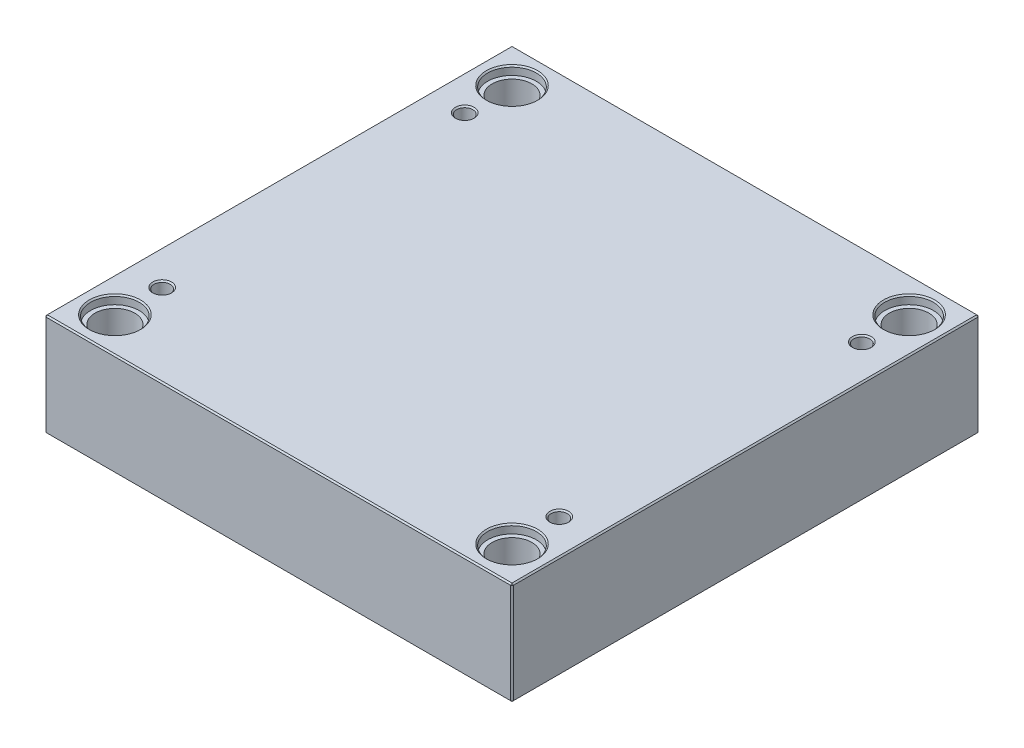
ISO-10303-21;
HEADER;
FILE_DESCRIPTION(('STEP AP214'),'2;1');
FILE_NAME('part.step','',(''),(''),'','','');
FILE_SCHEMA(('AUTOMOTIVE_DESIGN { 1 0 10303 214 1 1 1 1 }'));
ENDSEC;
DATA;
#1=APPLICATION_CONTEXT('core data for automotive mechanical design processes');
#2=APPLICATION_PROTOCOL_DEFINITION('international standard','automotive_design',2000,#1);
#3=PRODUCT_CONTEXT('',#1,'mechanical');
#4=PRODUCT('Part','Part','',(#3));
#5=PRODUCT_RELATED_PRODUCT_CATEGORY('part','',(#4));
#6=PRODUCT_DEFINITION_FORMATION('','',#4);
#7=PRODUCT_DEFINITION_CONTEXT('part definition',#1,'design');
#8=PRODUCT_DEFINITION('design','',#6,#7);
#9=PRODUCT_DEFINITION_SHAPE('','',#8);
#10=(LENGTH_UNIT() NAMED_UNIT(*) SI_UNIT(.MILLI.,.METRE.));
#11=(NAMED_UNIT(*) PLANE_ANGLE_UNIT() SI_UNIT($,.RADIAN.));
#12=(NAMED_UNIT(*) SI_UNIT($,.STERADIAN.) SOLID_ANGLE_UNIT());
#13=UNCERTAINTY_MEASURE_WITH_UNIT(LENGTH_MEASURE(1.E-05),#10,'distance_accuracy_value','');
#14=(GEOMETRIC_REPRESENTATION_CONTEXT(3) GLOBAL_UNCERTAINTY_ASSIGNED_CONTEXT((#13)) GLOBAL_UNIT_ASSIGNED_CONTEXT((#10,
#11,#12)) REPRESENTATION_CONTEXT('',''));
#15=CARTESIAN_POINT('',(0.,0.,0.));
#16=DIRECTION('',(0.,0.,1.));
#17=DIRECTION('',(1.,0.,0.));
#18=AXIS2_PLACEMENT_3D('',#15,#16,#17);
#19=CARTESIAN_POINT('',(-147.,0.,-147.));
#20=DIRECTION('',(0.,1.,0.));
#21=DIRECTION('',(0.,0.,1.));
#22=AXIS2_PLACEMENT_3D('',#19,#20,#21);
#23=CYLINDRICAL_SURFACE('',#22,14.7);
#24=CARTESIAN_POINT('',(-147.,0.999999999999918,-147.));
#25=DIRECTION('',(0.,1.,0.));
#26=DIRECTION('',(0.,0.,1.));
#27=AXIS2_PLACEMENT_3D('',#24,#25,#26);
#28=CIRCLE('',#27,14.7);
#29=CARTESIAN_POINT('',(-147.,0.999999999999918,-132.3));
#30=VERTEX_POINT('',#29);
#31=EDGE_CURVE('E471',#30,#30,#28,.F.);
#32=ORIENTED_EDGE('',*,*,#31,.T.);
#33=EDGE_LOOP('',(#32));
#34=FACE_BOUND('',#33,.T.);
#35=CARTESIAN_POINT('',(-147.,69.7,-147.));
#36=DIRECTION('',(0.,1.,0.));
#37=DIRECTION('',(0.,0.,1.));
#38=AXIS2_PLACEMENT_3D('',#35,#36,#37);
#39=CIRCLE('',#38,14.7);
#40=CARTESIAN_POINT('',(-147.,69.7,-132.3));
#41=VERTEX_POINT('',#40);
#42=EDGE_CURVE('E220',#41,#41,#39,.F.);
#43=ORIENTED_EDGE('',*,*,#42,.F.);
#44=EDGE_LOOP('',(#43));
#45=FACE_BOUND('',#44,.T.);
#46=ADVANCED_FACE('F15',(#34,#45),#23,.F.);
#47=CARTESIAN_POINT('',(147.,0.,-147.));
#48=DIRECTION('',(0.,1.,0.));
#49=DIRECTION('',(0.,0.,1.));
#50=AXIS2_PLACEMENT_3D('',#47,#48,#49);
#51=CYLINDRICAL_SURFACE('',#50,14.7);
#52=CARTESIAN_POINT('',(147.,0.999999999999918,-147.));
#53=DIRECTION('',(0.,1.,0.));
#54=DIRECTION('',(0.,0.,1.));
#55=AXIS2_PLACEMENT_3D('',#52,#53,#54);
#56=CIRCLE('',#55,14.7);
#57=CARTESIAN_POINT('',(147.,0.999999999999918,-132.3));
#58=VERTEX_POINT('',#57);
#59=EDGE_CURVE('E473',#58,#58,#56,.F.);
#60=ORIENTED_EDGE('',*,*,#59,.T.);
#61=EDGE_LOOP('',(#60));
#62=FACE_BOUND('',#61,.T.);
#63=CARTESIAN_POINT('',(147.,69.7,-147.));
#64=DIRECTION('',(0.,1.,0.));
#65=DIRECTION('',(0.,0.,1.));
#66=AXIS2_PLACEMENT_3D('',#63,#64,#65);
#67=CIRCLE('',#66,14.7);
#68=CARTESIAN_POINT('',(147.,69.7,-132.3));
#69=VERTEX_POINT('',#68);
#70=EDGE_CURVE('E217',#69,#69,#67,.F.);
#71=ORIENTED_EDGE('',*,*,#70,.F.);
#72=EDGE_LOOP('',(#71));
#73=FACE_BOUND('',#72,.T.);
#74=ADVANCED_FACE('F262',(#62,#73),#51,.F.);
#75=CARTESIAN_POINT('',(147.,0.,147.));
#76=DIRECTION('',(0.,1.,0.));
#77=DIRECTION('',(0.,0.,1.));
#78=AXIS2_PLACEMENT_3D('',#75,#76,#77);
#79=CYLINDRICAL_SURFACE('',#78,14.7);
#80=CARTESIAN_POINT('',(147.,0.999999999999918,147.));
#81=DIRECTION('',(0.,1.,0.));
#82=DIRECTION('',(0.,0.,1.));
#83=AXIS2_PLACEMENT_3D('',#80,#81,#82);
#84=CIRCLE('',#83,14.7);
#85=CARTESIAN_POINT('',(147.,0.999999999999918,161.7));
#86=VERTEX_POINT('',#85);
#87=EDGE_CURVE('E476',#86,#86,#84,.F.);
#88=ORIENTED_EDGE('',*,*,#87,.T.);
#89=EDGE_LOOP('',(#88));
#90=FACE_BOUND('',#89,.T.);
#91=CARTESIAN_POINT('',(147.,69.7,147.));
#92=DIRECTION('',(0.,1.,0.));
#93=DIRECTION('',(0.,0.,1.));
#94=AXIS2_PLACEMENT_3D('',#91,#92,#93);
#95=CIRCLE('',#94,14.7);
#96=CARTESIAN_POINT('',(147.,69.7,161.7));
#97=VERTEX_POINT('',#96);
#98=EDGE_CURVE('E213',#97,#97,#95,.F.);
#99=ORIENTED_EDGE('',*,*,#98,.F.);
#100=EDGE_LOOP('',(#99));
#101=FACE_BOUND('',#100,.T.);
#102=ADVANCED_FACE('F269',(#90,#101),#79,.F.);
#103=CARTESIAN_POINT('',(-147.,0.,147.));
#104=DIRECTION('',(0.,1.,0.));
#105=DIRECTION('',(0.,0.,1.));
#106=AXIS2_PLACEMENT_3D('',#103,#104,#105);
#107=CYLINDRICAL_SURFACE('',#106,14.7);
#108=CARTESIAN_POINT('',(-147.,0.999999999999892,147.));
#109=DIRECTION('',(0.,1.,0.));
#110=DIRECTION('',(0.,0.,1.));
#111=AXIS2_PLACEMENT_3D('',#108,#109,#110);
#112=CIRCLE('',#111,14.7);
#113=CARTESIAN_POINT('',(-147.,0.999999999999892,161.7));
#114=VERTEX_POINT('',#113);
#115=EDGE_CURVE('E479',#114,#114,#112,.F.);
#116=ORIENTED_EDGE('',*,*,#115,.T.);
#117=EDGE_LOOP('',(#116));
#118=FACE_BOUND('',#117,.T.);
#119=CARTESIAN_POINT('',(-147.,69.7,147.));
#120=DIRECTION('',(0.,1.,0.));
#121=DIRECTION('',(0.,0.,1.));
#122=AXIS2_PLACEMENT_3D('',#119,#120,#121);
#123=CIRCLE('',#122,14.7);
#124=CARTESIAN_POINT('',(-147.,69.7,161.7));
#125=VERTEX_POINT('',#124);
#126=EDGE_CURVE('E210',#125,#125,#123,.F.);
#127=ORIENTED_EDGE('',*,*,#126,.F.);
#128=EDGE_LOOP('',(#127));
#129=FACE_BOUND('',#128,.T.);
#130=ADVANCED_FACE('F276',(#118,#129),#107,.F.);
#131=CARTESIAN_POINT('',(-173.,76.,173.));
#132=DIRECTION('',(1.,0.,0.));
#133=DIRECTION('',(0.,0.,-1.));
#134=AXIS2_PLACEMENT_3D('',#131,#132,#133);
#135=PLANE('',#134);
#136=DIRECTION('',(0.,-1.,0.));
#137=VECTOR('',#136,1.);
#138=CARTESIAN_POINT('',(-173.,76.,-172.));
#139=LINE('',#138,#137);
#140=CARTESIAN_POINT('',(-173.,75.,-172.));
#141=VERTEX_POINT('',#140);
#142=CARTESIAN_POINT('',(-173.,0.999999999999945,-172.));
#143=VERTEX_POINT('',#142);
#144=EDGE_CURVE('E486',#141,#143,#139,.T.);
#145=ORIENTED_EDGE('',*,*,#144,.T.);
#146=DIRECTION('',(0.,0.,1.));
#147=VECTOR('',#146,1.);
#148=CARTESIAN_POINT('',(-173.,0.999999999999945,173.));
#149=LINE('',#148,#147);
#150=CARTESIAN_POINT('',(-173.,0.999999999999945,172.));
#151=VERTEX_POINT('',#150);
#152=EDGE_CURVE('E489',#143,#151,#149,.T.);
#153=ORIENTED_EDGE('',*,*,#152,.T.);
#154=DIRECTION('',(0.,1.,0.));
#155=VECTOR('',#154,1.);
#156=CARTESIAN_POINT('',(-173.,76.,172.));
#157=LINE('',#156,#155);
#158=CARTESIAN_POINT('',(-173.,75.,172.));
#159=VERTEX_POINT('',#158);
#160=EDGE_CURVE('E484',#151,#159,#157,.T.);
#161=ORIENTED_EDGE('',*,*,#160,.T.);
#162=DIRECTION('',(0.,0.,-1.));
#163=VECTOR('',#162,1.);
#164=CARTESIAN_POINT('',(-173.,75.,-173.));
#165=LINE('',#164,#163);
#166=EDGE_CURVE('E482',#159,#141,#165,.T.);
#167=ORIENTED_EDGE('',*,*,#166,.T.);
#168=EDGE_LOOP('',(#145,#153,#161,#167));
#169=FACE_BOUND('',#168,.T.);
#170=ADVANCED_FACE('F297',(#169),#135,.F.);
#171=CARTESIAN_POINT('',(173.,76.,173.));
#172=DIRECTION('',(0.,0.,-1.));
#173=DIRECTION('',(-1.,0.,0.));
#174=AXIS2_PLACEMENT_3D('',#171,#172,#173);
#175=PLANE('',#174);
#176=DIRECTION('',(-1.,0.,0.));
#177=VECTOR('',#176,1.);
#178=CARTESIAN_POINT('',(-173.,75.,173.));
#179=LINE('',#178,#177);
#180=CARTESIAN_POINT('',(172.,75.,173.));
#181=VERTEX_POINT('',#180);
#182=CARTESIAN_POINT('',(-172.,75.,173.));
#183=VERTEX_POINT('',#182);
#184=EDGE_CURVE('E508',#181,#183,#179,.T.);
#185=ORIENTED_EDGE('',*,*,#184,.T.);
#186=DIRECTION('',(0.,-1.,0.));
#187=VECTOR('',#186,1.);
#188=CARTESIAN_POINT('',(-172.,76.,173.));
#189=LINE('',#188,#187);
#190=CARTESIAN_POINT('',(-172.,0.999999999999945,173.));
#191=VERTEX_POINT('',#190);
#192=EDGE_CURVE('E514',#183,#191,#189,.T.);
#193=ORIENTED_EDGE('',*,*,#192,.T.);
#194=DIRECTION('',(1.,0.,0.));
#195=VECTOR('',#194,1.);
#196=CARTESIAN_POINT('',(173.,0.999999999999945,173.));
#197=LINE('',#196,#195);
#198=CARTESIAN_POINT('',(172.,0.999999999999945,173.));
#199=VERTEX_POINT('',#198);
#200=EDGE_CURVE('E512',#191,#199,#197,.T.);
#201=ORIENTED_EDGE('',*,*,#200,.T.);
#202=DIRECTION('',(0.,1.,0.));
#203=VECTOR('',#202,1.);
#204=CARTESIAN_POINT('',(172.,76.,173.));
#205=LINE('',#204,#203);
#206=EDGE_CURVE('E510',#199,#181,#205,.T.);
#207=ORIENTED_EDGE('',*,*,#206,.T.);
#208=EDGE_LOOP('',(#185,#193,#201,#207));
#209=FACE_BOUND('',#208,.T.);
#210=ADVANCED_FACE('F293',(#209),#175,.F.);
#211=CARTESIAN_POINT('',(173.,76.,173.));
#212=DIRECTION('',(-1.,0.,0.));
#213=DIRECTION('',(0.,0.,1.));
#214=AXIS2_PLACEMENT_3D('',#211,#212,#213);
#215=PLANE('',#214);
#216=DIRECTION('',(0.,0.,-1.));
#217=VECTOR('',#216,1.);
#218=CARTESIAN_POINT('',(173.,0.999999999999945,173.));
#219=LINE('',#218,#217);
#220=CARTESIAN_POINT('',(173.,0.999999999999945,172.));
#221=VERTEX_POINT('',#220);
#222=CARTESIAN_POINT('',(173.,0.999999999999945,-172.));
#223=VERTEX_POINT('',#222);
#224=EDGE_CURVE('E503',#221,#223,#219,.T.);
#225=ORIENTED_EDGE('',*,*,#224,.T.);
#226=DIRECTION('',(0.,1.,0.));
#227=VECTOR('',#226,1.);
#228=CARTESIAN_POINT('',(173.,76.,-172.));
#229=LINE('',#228,#227);
#230=CARTESIAN_POINT('',(173.,75.,-172.));
#231=VERTEX_POINT('',#230);
#232=EDGE_CURVE('E505',#223,#231,#229,.T.);
#233=ORIENTED_EDGE('',*,*,#232,.T.);
#234=DIRECTION('',(0.,0.,1.));
#235=VECTOR('',#234,1.);
#236=CARTESIAN_POINT('',(173.,75.,173.));
#237=LINE('',#236,#235);
#238=CARTESIAN_POINT('',(173.,75.,172.));
#239=VERTEX_POINT('',#238);
#240=EDGE_CURVE('E499',#231,#239,#237,.T.);
#241=ORIENTED_EDGE('',*,*,#240,.T.);
#242=DIRECTION('',(0.,-1.,0.));
#243=VECTOR('',#242,1.);
#244=CARTESIAN_POINT('',(173.,76.,172.));
#245=LINE('',#244,#243);
#246=EDGE_CURVE('E501',#239,#221,#245,.T.);
#247=ORIENTED_EDGE('',*,*,#246,.T.);
#248=EDGE_LOOP('',(#225,#233,#241,#247));
#249=FACE_BOUND('',#248,.T.);
#250=ADVANCED_FACE('F289',(#249),#215,.F.);
#251=CARTESIAN_POINT('',(173.,76.,-173.));
#252=DIRECTION('',(0.,0.,1.));
#253=DIRECTION('',(1.,0.,0.));
#254=AXIS2_PLACEMENT_3D('',#251,#252,#253);
#255=PLANE('',#254);
#256=DIRECTION('',(0.,-1.,0.));
#257=VECTOR('',#256,1.);
#258=CARTESIAN_POINT('',(172.,76.,-173.));
#259=LINE('',#258,#257);
#260=CARTESIAN_POINT('',(172.,75.,-173.));
#261=VERTEX_POINT('',#260);
#262=CARTESIAN_POINT('',(172.,0.999999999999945,-173.));
#263=VERTEX_POINT('',#262);
#264=EDGE_CURVE('E493',#261,#263,#259,.T.);
#265=ORIENTED_EDGE('',*,*,#264,.T.);
#266=DIRECTION('',(-1.,0.,0.));
#267=VECTOR('',#266,1.);
#268=CARTESIAN_POINT('',(173.,0.999999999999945,-173.));
#269=LINE('',#268,#267);
#270=CARTESIAN_POINT('',(-172.,0.999999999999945,-173.));
#271=VERTEX_POINT('',#270);
#272=EDGE_CURVE('E137',#263,#271,#269,.T.);
#273=ORIENTED_EDGE('',*,*,#272,.T.);
#274=DIRECTION('',(0.,1.,0.));
#275=VECTOR('',#274,1.);
#276=CARTESIAN_POINT('',(-172.,76.,-173.));
#277=LINE('',#276,#275);
#278=CARTESIAN_POINT('',(-172.,75.,-173.));
#279=VERTEX_POINT('',#278);
#280=EDGE_CURVE('E495',#271,#279,#277,.T.);
#281=ORIENTED_EDGE('',*,*,#280,.T.);
#282=DIRECTION('',(1.,0.,0.));
#283=VECTOR('',#282,1.);
#284=CARTESIAN_POINT('',(173.,75.,-173.));
#285=LINE('',#284,#283);
#286=EDGE_CURVE('E491',#279,#261,#285,.T.);
#287=ORIENTED_EDGE('',*,*,#286,.T.);
#288=EDGE_LOOP('',(#265,#273,#281,#287));
#289=FACE_BOUND('',#288,.T.);
#290=ADVANCED_FACE('F281',(#289),#255,.F.);
#291=CARTESIAN_POINT('',(0.,76.,0.));
#292=DIRECTION('',(0.,1.,0.));
#293=DIRECTION('',(0.,0.,1.));
#294=AXIS2_PLACEMENT_3D('',#291,#292,#293);
#295=PLANE('',#294);
#296=CARTESIAN_POINT('',(147.,76.,147.));
#297=DIRECTION('',(0.,1.,0.));
#298=DIRECTION('',(0.,0.,1.));
#299=AXIS2_PLACEMENT_3D('',#296,#297,#298);
#300=CIRCLE('',#299,19.);
#301=CARTESIAN_POINT('',(147.,76.,166.));
#302=VERTEX_POINT('',#301);
#303=EDGE_CURVE('E235',#302,#302,#300,.F.);
#304=ORIENTED_EDGE('',*,*,#303,.T.);
#305=EDGE_LOOP('',(#304));
#306=FACE_BOUND('',#305,.T.);
#307=CARTESIAN_POINT('',(-147.,76.,147.));
#308=DIRECTION('',(0.,1.,0.));
#309=DIRECTION('',(0.,0.,1.));
#310=AXIS2_PLACEMENT_3D('',#307,#308,#309);
#311=CIRCLE('',#310,19.);
#312=CARTESIAN_POINT('',(-147.,76.,166.));
#313=VERTEX_POINT('',#312);
#314=EDGE_CURVE('E232',#313,#313,#311,.F.);
#315=ORIENTED_EDGE('',*,*,#314,.T.);
#316=EDGE_LOOP('',(#315));
#317=FACE_BOUND('',#316,.T.);
#318=CARTESIAN_POINT('',(147.,76.,-147.));
#319=DIRECTION('',(0.,1.,0.));
#320=DIRECTION('',(0.,0.,1.));
#321=AXIS2_PLACEMENT_3D('',#318,#319,#320);
#322=CIRCLE('',#321,19.);
#323=CARTESIAN_POINT('',(147.,76.,-128.));
#324=VERTEX_POINT('',#323);
#325=EDGE_CURVE('E229',#324,#324,#322,.F.);
#326=ORIENTED_EDGE('',*,*,#325,.T.);
#327=EDGE_LOOP('',(#326));
#328=FACE_BOUND('',#327,.T.);
#329=CARTESIAN_POINT('',(-147.,76.,-147.));
#330=DIRECTION('',(0.,1.,0.));
#331=DIRECTION('',(0.,0.,1.));
#332=AXIS2_PLACEMENT_3D('',#329,#330,#331);
#333=CIRCLE('',#332,19.);
#334=CARTESIAN_POINT('',(-147.,76.,-128.));
#335=VERTEX_POINT('',#334);
#336=EDGE_CURVE('E226',#335,#335,#333,.F.);
#337=ORIENTED_EDGE('',*,*,#336,.T.);
#338=EDGE_LOOP('',(#337));
#339=FACE_BOUND('',#338,.T.);
#340=CARTESIAN_POINT('',(-147.,76.,112.));
#341=DIRECTION('',(0.,1.,0.));
#342=DIRECTION('',(0.,0.,1.));
#343=AXIS2_PLACEMENT_3D('',#340,#341,#342);
#344=CIRCLE('',#343,7.);
#345=CARTESIAN_POINT('',(-147.,76.,119.));
#346=VERTEX_POINT('',#345);
#347=EDGE_CURVE('E197',#346,#346,#344,.F.);
#348=ORIENTED_EDGE('',*,*,#347,.T.);
#349=EDGE_LOOP('',(#348));
#350=FACE_BOUND('',#349,.T.);
#351=CARTESIAN_POINT('',(147.,76.,112.));
#352=DIRECTION('',(0.,1.,0.));
#353=DIRECTION('',(0.,0.,1.));
#354=AXIS2_PLACEMENT_3D('',#351,#352,#353);
#355=CIRCLE('',#354,7.00000000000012);
#356=CARTESIAN_POINT('',(147.,76.,119.));
#357=VERTEX_POINT('',#356);
#358=EDGE_CURVE('E194',#357,#357,#355,.F.);
#359=ORIENTED_EDGE('',*,*,#358,.T.);
#360=EDGE_LOOP('',(#359));
#361=FACE_BOUND('',#360,.T.);
#362=CARTESIAN_POINT('',(147.,76.,-112.));
#363=DIRECTION('',(0.,1.,0.));
#364=DIRECTION('',(0.,0.,1.));
#365=AXIS2_PLACEMENT_3D('',#362,#363,#364);
#366=CIRCLE('',#365,7.00000000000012);
#367=CARTESIAN_POINT('',(147.,76.,-105.));
#368=VERTEX_POINT('',#367);
#369=EDGE_CURVE('E191',#368,#368,#366,.F.);
#370=ORIENTED_EDGE('',*,*,#369,.T.);
#371=EDGE_LOOP('',(#370));
#372=FACE_BOUND('',#371,.T.);
#373=CARTESIAN_POINT('',(-147.,76.,-112.));
#374=DIRECTION('',(0.,1.,0.));
#375=DIRECTION('',(0.,0.,1.));
#376=AXIS2_PLACEMENT_3D('',#373,#374,#375);
#377=CIRCLE('',#376,7.);
#378=CARTESIAN_POINT('',(-147.,76.,-105.));
#379=VERTEX_POINT('',#378);
#380=EDGE_CURVE('E187',#379,#379,#377,.F.);
#381=ORIENTED_EDGE('',*,*,#380,.T.);
#382=EDGE_LOOP('',(#381));
#383=FACE_BOUND('',#382,.T.);
#384=DIRECTION('',(0.,0.,-1.));
#385=VECTOR('',#384,1.);
#386=CARTESIAN_POINT('',(172.,76.,-173.));
#387=LINE('',#386,#385);
#388=CARTESIAN_POINT('',(172.,76.,172.));
#389=VERTEX_POINT('',#388);
#390=CARTESIAN_POINT('',(172.,76.,-172.));
#391=VERTEX_POINT('',#390);
#392=EDGE_CURVE('E30',#389,#391,#387,.T.);
#393=ORIENTED_EDGE('',*,*,#392,.T.);
#394=DIRECTION('',(-1.,0.,0.));
#395=VECTOR('',#394,1.);
#396=CARTESIAN_POINT('',(-173.,76.,-172.));
#397=LINE('',#396,#395);
#398=CARTESIAN_POINT('',(-172.,76.,-172.));
#399=VERTEX_POINT('',#398);
#400=EDGE_CURVE('E188',#391,#399,#397,.T.);
#401=ORIENTED_EDGE('',*,*,#400,.T.);
#402=DIRECTION('',(0.,0.,1.));
#403=VECTOR('',#402,1.);
#404=CARTESIAN_POINT('',(-172.,76.,173.));
#405=LINE('',#404,#403);
#406=CARTESIAN_POINT('',(-172.,76.,172.));
#407=VERTEX_POINT('',#406);
#408=EDGE_CURVE('E517',#399,#407,#405,.T.);
#409=ORIENTED_EDGE('',*,*,#408,.T.);
#410=DIRECTION('',(1.,0.,0.));
#411=VECTOR('',#410,1.);
#412=CARTESIAN_POINT('',(173.,76.,172.));
#413=LINE('',#412,#411);
#414=EDGE_CURVE('E35',#407,#389,#413,.T.);
#415=ORIENTED_EDGE('',*,*,#414,.T.);
#416=EDGE_LOOP('',(#393,#401,#409,#415));
#417=FACE_BOUND('',#416,.T.);
#418=ADVANCED_FACE('F278',(#306,#317,#328,#339,#350,#361,#372,#383,#417),#295,.T.);
#419=CARTESIAN_POINT('',(0.,0.,0.));
#420=DIRECTION('',(0.,1.,0.));
#421=DIRECTION('',(0.,0.,1.));
#422=AXIS2_PLACEMENT_3D('',#419,#420,#421);
#423=PLANE('',#422);
#424=CARTESIAN_POINT('',(-147.,0.,-147.));
#425=DIRECTION('',(0.,1.,0.));
#426=DIRECTION('',(0.,0.,1.));
#427=AXIS2_PLACEMENT_3D('',#424,#425,#426);
#428=CIRCLE('',#427,15.7);
#429=CARTESIAN_POINT('',(-147.,0.,-131.3));
#430=VERTEX_POINT('',#429);
#431=EDGE_CURVE('E468',#430,#430,#428,.T.);
#432=ORIENTED_EDGE('',*,*,#431,.T.);
#433=EDGE_LOOP('',(#432));
#434=FACE_BOUND('',#433,.T.);
#435=CARTESIAN_POINT('',(147.,0.,-147.));
#436=DIRECTION('',(0.,1.,0.));
#437=DIRECTION('',(0.,0.,1.));
#438=AXIS2_PLACEMENT_3D('',#435,#436,#437);
#439=CIRCLE('',#438,15.7);
#440=CARTESIAN_POINT('',(147.,0.,-131.3));
#441=VERTEX_POINT('',#440);
#442=EDGE_CURVE('E465',#441,#441,#439,.T.);
#443=ORIENTED_EDGE('',*,*,#442,.T.);
#444=EDGE_LOOP('',(#443));
#445=FACE_BOUND('',#444,.T.);
#446=CARTESIAN_POINT('',(147.,0.,147.));
#447=DIRECTION('',(0.,1.,0.));
#448=DIRECTION('',(0.,0.,1.));
#449=AXIS2_PLACEMENT_3D('',#446,#447,#448);
#450=CIRCLE('',#449,15.7);
#451=CARTESIAN_POINT('',(147.,0.,162.7));
#452=VERTEX_POINT('',#451);
#453=EDGE_CURVE('E462',#452,#452,#450,.T.);
#454=ORIENTED_EDGE('',*,*,#453,.T.);
#455=EDGE_LOOP('',(#454));
#456=FACE_BOUND('',#455,.T.);
#457=CARTESIAN_POINT('',(-147.,0.,147.));
#458=DIRECTION('',(0.,1.,0.));
#459=DIRECTION('',(0.,0.,1.));
#460=AXIS2_PLACEMENT_3D('',#457,#458,#459);
#461=CIRCLE('',#460,15.7);
#462=CARTESIAN_POINT('',(-147.,0.,162.7));
#463=VERTEX_POINT('',#462);
#464=EDGE_CURVE('E459',#463,#463,#461,.T.);
#465=ORIENTED_EDGE('',*,*,#464,.T.);
#466=EDGE_LOOP('',(#465));
#467=FACE_BOUND('',#466,.T.);
#468=DIRECTION('',(0.,0.,1.));
#469=VECTOR('',#468,1.);
#470=CARTESIAN_POINT('',(172.,0.,0.));
#471=LINE('',#470,#469);
#472=CARTESIAN_POINT('',(172.,0.,-172.));
#473=VERTEX_POINT('',#472);
#474=CARTESIAN_POINT('',(172.,0.,172.));
#475=VERTEX_POINT('',#474);
#476=EDGE_CURVE('E107',#473,#475,#471,.T.);
#477=ORIENTED_EDGE('',*,*,#476,.T.);
#478=DIRECTION('',(-1.,0.,0.));
#479=VECTOR('',#478,1.);
#480=CARTESIAN_POINT('',(0.,0.,172.));
#481=LINE('',#480,#479);
#482=CARTESIAN_POINT('',(-172.,0.,172.));
#483=VERTEX_POINT('',#482);
#484=EDGE_CURVE('E457',#475,#483,#481,.T.);
#485=ORIENTED_EDGE('',*,*,#484,.T.);
#486=DIRECTION('',(0.,0.,-1.));
#487=VECTOR('',#486,1.);
#488=CARTESIAN_POINT('',(-172.,0.,0.));
#489=LINE('',#488,#487);
#490=CARTESIAN_POINT('',(-172.,0.,-172.));
#491=VERTEX_POINT('',#490);
#492=EDGE_CURVE('E109',#483,#491,#489,.T.);
#493=ORIENTED_EDGE('',*,*,#492,.T.);
#494=DIRECTION('',(1.,0.,0.));
#495=VECTOR('',#494,1.);
#496=CARTESIAN_POINT('',(0.,0.,-172.));
#497=LINE('',#496,#495);
#498=EDGE_CURVE('E103',#491,#473,#497,.T.);
#499=ORIENTED_EDGE('',*,*,#498,.T.);
#500=EDGE_LOOP('',(#477,#485,#493,#499));
#501=FACE_BOUND('',#500,.T.);
#502=ADVANCED_FACE('F105',(#434,#445,#456,#467,#501),#423,.F.);
#503=CARTESIAN_POINT('',(-147.,0.,-147.));
#504=DIRECTION('',(0.,-1.,0.));
#505=DIRECTION('',(0.,0.,-1.));
#506=AXIS2_PLACEMENT_3D('',#503,#504,#505);
#507=CONICAL_SURFACE('',#506,15.7,0.785398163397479);
#508=ORIENTED_EDGE('',*,*,#31,.F.);
#509=EDGE_LOOP('',(#508));
#510=FACE_BOUND('',#509,.T.);
#511=ORIENTED_EDGE('',*,*,#431,.F.);
#512=EDGE_LOOP('',(#511));
#513=FACE_BOUND('',#512,.T.);
#514=ADVANCED_FACE('F285',(#510,#513),#507,.F.);
#515=CARTESIAN_POINT('',(147.,0.,-147.));
#516=DIRECTION('',(0.,-1.,0.));
#517=DIRECTION('',(0.,0.,-1.));
#518=AXIS2_PLACEMENT_3D('',#515,#516,#517);
#519=CONICAL_SURFACE('',#518,15.7,0.785398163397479);
#520=ORIENTED_EDGE('',*,*,#59,.F.);
#521=EDGE_LOOP('',(#520));
#522=FACE_BOUND('',#521,.T.);
#523=ORIENTED_EDGE('',*,*,#442,.F.);
#524=EDGE_LOOP('',(#523));
#525=FACE_BOUND('',#524,.T.);
#526=ADVANCED_FACE('F304',(#522,#525),#519,.F.);
#527=CARTESIAN_POINT('',(147.,0.,147.));
#528=DIRECTION('',(0.,-1.,0.));
#529=DIRECTION('',(0.,0.,-1.));
#530=AXIS2_PLACEMENT_3D('',#527,#528,#529);
#531=CONICAL_SURFACE('',#530,15.7,0.785398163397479);
#532=ORIENTED_EDGE('',*,*,#87,.F.);
#533=EDGE_LOOP('',(#532));
#534=FACE_BOUND('',#533,.T.);
#535=ORIENTED_EDGE('',*,*,#453,.F.);
#536=EDGE_LOOP('',(#535));
#537=FACE_BOUND('',#536,.T.);
#538=ADVANCED_FACE('F308',(#534,#537),#531,.F.);
#539=CARTESIAN_POINT('',(-147.,0.,147.));
#540=DIRECTION('',(0.,-1.,0.));
#541=DIRECTION('',(0.,0.,-1.));
#542=AXIS2_PLACEMENT_3D('',#539,#540,#541);
#543=CONICAL_SURFACE('',#542,15.7,0.785398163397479);
#544=ORIENTED_EDGE('',*,*,#115,.F.);
#545=EDGE_LOOP('',(#544));
#546=FACE_BOUND('',#545,.T.);
#547=ORIENTED_EDGE('',*,*,#464,.F.);
#548=EDGE_LOOP('',(#547));
#549=FACE_BOUND('',#548,.T.);
#550=ADVANCED_FACE('F312',(#546,#549),#543,.F.);
#551=CARTESIAN_POINT('',(173.,76.,172.));
#552=DIRECTION('',(-0.707106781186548,0.,-0.707106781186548));
#553=DIRECTION('',(0.,-1.,0.));
#554=AXIS2_PLACEMENT_3D('',#551,#552,#553);
#555=PLANE('',#554);
#556=DIRECTION('',(-0.707106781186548,0.,0.707106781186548));
#557=VECTOR('',#556,1.);
#558=CARTESIAN_POINT('',(172.,75.,173.));
#559=LINE('',#558,#557);
#560=EDGE_CURVE('E125',#181,#239,#559,.F.);
#561=ORIENTED_EDGE('',*,*,#560,.F.);
#562=ORIENTED_EDGE('',*,*,#206,.F.);
#563=DIRECTION('',(0.707106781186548,0.,-0.707106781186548));
#564=VECTOR('',#563,1.);
#565=CARTESIAN_POINT('',(172.,0.999999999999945,173.));
#566=LINE('',#565,#564);
#567=EDGE_CURVE('E179',#221,#199,#566,.F.);
#568=ORIENTED_EDGE('',*,*,#567,.F.);
#569=ORIENTED_EDGE('',*,*,#246,.F.);
#570=EDGE_LOOP('',(#561,#562,#568,#569));
#571=FACE_BOUND('',#570,.T.);
#572=ADVANCED_FACE('F316',(#571),#555,.F.);
#573=CARTESIAN_POINT('',(172.,75.,173.));
#574=DIRECTION('',(0.57735026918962,0.577350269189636,0.57735026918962));
#575=DIRECTION('',(0.,-0.707106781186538,0.707106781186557));
#576=AXIS2_PLACEMENT_3D('',#573,#574,#575);
#577=PLANE('',#576);
#578=DIRECTION('',(0.,-0.707106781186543,0.707106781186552));
#579=VECTOR('',#578,1.);
#580=CARTESIAN_POINT('',(172.,75.,173.));
#581=LINE('',#580,#579);
#582=EDGE_CURVE('E174',#181,#389,#581,.F.);
#583=ORIENTED_EDGE('',*,*,#582,.F.);
#584=ORIENTED_EDGE('',*,*,#560,.T.);
#585=DIRECTION('',(-0.707106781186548,0.707106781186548,0.));
#586=VECTOR('',#585,1.);
#587=CARTESIAN_POINT('',(172.5,75.5,172.));
#588=LINE('',#587,#586);
#589=EDGE_CURVE('E176',#389,#239,#588,.F.);
#590=ORIENTED_EDGE('',*,*,#589,.F.);
#591=EDGE_LOOP('',(#583,#584,#590));
#592=FACE_BOUND('',#591,.T.);
#593=ADVANCED_FACE('F384',(#592),#577,.T.);
#594=CARTESIAN_POINT('',(172.,0.999999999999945,173.));
#595=DIRECTION('',(0.577350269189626,-0.577350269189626,0.577350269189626));
#596=DIRECTION('',(0.707106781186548,0.,-0.707106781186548));
#597=AXIS2_PLACEMENT_3D('',#594,#595,#596);
#598=PLANE('',#597);
#599=DIRECTION('',(-0.707106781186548,-0.707106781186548,0.));
#600=VECTOR('',#599,1.);
#601=CARTESIAN_POINT('',(172.5,0.499999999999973,172.));
#602=LINE('',#601,#600);
#603=EDGE_CURVE('E123',#221,#475,#602,.T.);
#604=ORIENTED_EDGE('',*,*,#603,.F.);
#605=ORIENTED_EDGE('',*,*,#567,.T.);
#606=DIRECTION('',(0.,0.707106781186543,0.707106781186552));
#607=VECTOR('',#606,1.);
#608=CARTESIAN_POINT('',(172.,0.999999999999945,173.));
#609=LINE('',#608,#607);
#610=EDGE_CURVE('E171',#475,#199,#609,.T.);
#611=ORIENTED_EDGE('',*,*,#610,.F.);
#612=EDGE_LOOP('',(#604,#605,#611));
#613=FACE_BOUND('',#612,.T.);
#614=ADVANCED_FACE('F380',(#613),#598,.T.);
#615=CARTESIAN_POINT('',(172.,76.,0.));
#616=DIRECTION('',(0.707106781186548,0.707106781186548,0.));
#617=DIRECTION('',(0.,0.,1.));
#618=AXIS2_PLACEMENT_3D('',#615,#616,#617);
#619=PLANE('',#618);
#620=ORIENTED_EDGE('',*,*,#589,.T.);
#621=ORIENTED_EDGE('',*,*,#240,.F.);
#622=DIRECTION('',(0.707106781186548,-0.707106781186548,0.));
#623=VECTOR('',#622,1.);
#624=CARTESIAN_POINT('',(173.,75.,-172.));
#625=LINE('',#624,#623);
#626=EDGE_CURVE('E165',#391,#231,#625,.T.);
#627=ORIENTED_EDGE('',*,*,#626,.F.);
#628=ORIENTED_EDGE('',*,*,#392,.F.);
#629=EDGE_LOOP('',(#620,#621,#627,#628));
#630=FACE_BOUND('',#629,.T.);
#631=ADVANCED_FACE('F376',(#630),#619,.T.);
#632=CARTESIAN_POINT('',(0.,76.,172.));
#633=DIRECTION('',(0.,0.707106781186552,0.707106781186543));
#634=DIRECTION('',(-1.,0.,0.));
#635=AXIS2_PLACEMENT_3D('',#632,#633,#634);
#636=PLANE('',#635);
#637=ORIENTED_EDGE('',*,*,#582,.T.);
#638=ORIENTED_EDGE('',*,*,#414,.F.);
#639=DIRECTION('',(0.,0.707106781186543,-0.707106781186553));
#640=VECTOR('',#639,1.);
#641=CARTESIAN_POINT('',(-172.,75.5,172.5));
#642=LINE('',#641,#640);
#643=EDGE_CURVE('E162',#183,#407,#642,.T.);
#644=ORIENTED_EDGE('',*,*,#643,.F.);
#645=ORIENTED_EDGE('',*,*,#184,.F.);
#646=EDGE_LOOP('',(#637,#638,#644,#645));
#647=FACE_BOUND('',#646,.T.);
#648=ADVANCED_FACE('F372',(#647),#636,.T.);
#649=CARTESIAN_POINT('',(-172.,76.,173.));
#650=DIRECTION('',(0.707106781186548,0.,-0.707106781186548));
#651=DIRECTION('',(0.,-1.,0.));
#652=AXIS2_PLACEMENT_3D('',#649,#650,#651);
#653=PLANE('',#652);
#654=DIRECTION('',(0.707106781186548,0.,0.707106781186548));
#655=VECTOR('',#654,1.);
#656=CARTESIAN_POINT('',(-172.,0.999999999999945,173.));
#657=LINE('',#656,#655);
#658=EDGE_CURVE('E156',#191,#151,#657,.F.);
#659=ORIENTED_EDGE('',*,*,#658,.F.);
#660=ORIENTED_EDGE('',*,*,#192,.F.);
#661=DIRECTION('',(-0.707106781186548,0.,-0.707106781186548));
#662=VECTOR('',#661,1.);
#663=CARTESIAN_POINT('',(-173.,75.,172.));
#664=LINE('',#663,#662);
#665=EDGE_CURVE('E159',#159,#183,#664,.F.);
#666=ORIENTED_EDGE('',*,*,#665,.F.);
#667=ORIENTED_EDGE('',*,*,#160,.F.);
#668=EDGE_LOOP('',(#659,#660,#666,#667));
#669=FACE_BOUND('',#668,.T.);
#670=ADVANCED_FACE('F368',(#669),#653,.F.);
#671=CARTESIAN_POINT('',(173.,0.999999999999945,173.));
#672=DIRECTION('',(0.,0.707106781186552,-0.707106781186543));
#673=DIRECTION('',(1.,0.,0.));
#674=AXIS2_PLACEMENT_3D('',#671,#672,#673);
#675=PLANE('',#674);
#676=ORIENTED_EDGE('',*,*,#610,.T.);
#677=ORIENTED_EDGE('',*,*,#200,.F.);
#678=DIRECTION('',(0.,-0.707106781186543,-0.707106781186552));
#679=VECTOR('',#678,1.);
#680=CARTESIAN_POINT('',(-172.,0.999999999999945,173.));
#681=LINE('',#680,#679);
#682=EDGE_CURVE('E134',#483,#191,#681,.F.);
#683=ORIENTED_EDGE('',*,*,#682,.F.);
#684=ORIENTED_EDGE('',*,*,#484,.F.);
#685=EDGE_LOOP('',(#676,#677,#683,#684));
#686=FACE_BOUND('',#685,.T.);
#687=ADVANCED_FACE('F365',(#686),#675,.F.);
#688=CARTESIAN_POINT('',(173.,0.999999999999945,173.));
#689=DIRECTION('',(-0.707106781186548,0.707106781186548,0.));
#690=DIRECTION('',(0.,0.,-1.));
#691=AXIS2_PLACEMENT_3D('',#688,#689,#690);
#692=PLANE('',#691);
#693=ORIENTED_EDGE('',*,*,#603,.T.);
#694=ORIENTED_EDGE('',*,*,#476,.F.);
#695=DIRECTION('',(0.707106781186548,0.707106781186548,0.));
#696=VECTOR('',#695,1.);
#697=CARTESIAN_POINT('',(172.5,0.499999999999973,-172.));
#698=LINE('',#697,#696);
#699=EDGE_CURVE('E120',#223,#473,#698,.F.);
#700=ORIENTED_EDGE('',*,*,#699,.F.);
#701=ORIENTED_EDGE('',*,*,#224,.F.);
#702=EDGE_LOOP('',(#693,#694,#700,#701));
#703=FACE_BOUND('',#702,.T.);
#704=ADVANCED_FACE('F118',(#703),#692,.F.);
#705=CARTESIAN_POINT('',(172.,76.,-173.));
#706=DIRECTION('',(-0.707106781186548,0.,0.707106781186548));
#707=DIRECTION('',(0.,-1.,0.));
#708=AXIS2_PLACEMENT_3D('',#705,#706,#707);
#709=PLANE('',#708);
#710=DIRECTION('',(0.707106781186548,0.,0.707106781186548));
#711=VECTOR('',#710,1.);
#712=CARTESIAN_POINT('',(173.,75.,-172.));
#713=LINE('',#712,#711);
#714=EDGE_CURVE('E167',#231,#261,#713,.F.);
#715=ORIENTED_EDGE('',*,*,#714,.F.);
#716=ORIENTED_EDGE('',*,*,#232,.F.);
#717=DIRECTION('',(-0.707106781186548,0.,-0.707106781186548));
#718=VECTOR('',#717,1.);
#719=CARTESIAN_POINT('',(172.,0.999999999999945,-173.));
#720=LINE('',#719,#718);
#721=EDGE_CURVE('E133',#263,#223,#720,.F.);
#722=ORIENTED_EDGE('',*,*,#721,.F.);
#723=ORIENTED_EDGE('',*,*,#264,.F.);
#724=EDGE_LOOP('',(#715,#716,#722,#723));
#725=FACE_BOUND('',#724,.T.);
#726=ADVANCED_FACE('F358',(#725),#709,.F.);
#727=CARTESIAN_POINT('',(173.,75.,-172.));
#728=DIRECTION('',(0.577350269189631,0.577350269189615,-0.577350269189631));
#729=DIRECTION('',(-0.707106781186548,0.,-0.707106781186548));
#730=AXIS2_PLACEMENT_3D('',#727,#728,#729);
#731=PLANE('',#730);
#732=ORIENTED_EDGE('',*,*,#626,.T.);
#733=ORIENTED_EDGE('',*,*,#714,.T.);
#734=DIRECTION('',(0.,0.707106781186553,0.707106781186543));
#735=VECTOR('',#734,1.);
#736=CARTESIAN_POINT('',(172.,75.5,-172.5));
#737=LINE('',#736,#735);
#738=EDGE_CURVE('E151',#391,#261,#737,.F.);
#739=ORIENTED_EDGE('',*,*,#738,.F.);
#740=EDGE_LOOP('',(#732,#733,#739));
#741=FACE_BOUND('',#740,.T.);
#742=ADVANCED_FACE('F354',(#741),#731,.T.);
#743=CARTESIAN_POINT('',(-173.,75.,172.));
#744=DIRECTION('',(-0.57735026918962,0.577350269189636,0.57735026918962));
#745=DIRECTION('',(0.,-0.707106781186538,0.707106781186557));
#746=AXIS2_PLACEMENT_3D('',#743,#744,#745);
#747=PLANE('',#746);
#748=ORIENTED_EDGE('',*,*,#665,.T.);
#749=ORIENTED_EDGE('',*,*,#643,.T.);
#750=DIRECTION('',(-0.707106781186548,-0.707106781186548,0.));
#751=VECTOR('',#750,1.);
#752=CARTESIAN_POINT('',(-173.,75.,172.));
#753=LINE('',#752,#751);
#754=EDGE_CURVE('E142',#159,#407,#753,.F.);
#755=ORIENTED_EDGE('',*,*,#754,.F.);
#756=EDGE_LOOP('',(#748,#749,#755));
#757=FACE_BOUND('',#756,.T.);
#758=ADVANCED_FACE('F350',(#757),#747,.T.);
#759=CARTESIAN_POINT('',(-172.,0.999999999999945,173.));
#760=DIRECTION('',(-0.577350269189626,-0.577350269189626,0.577350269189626));
#761=DIRECTION('',(0.707106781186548,0.,0.707106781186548));
#762=AXIS2_PLACEMENT_3D('',#759,#760,#761);
#763=PLANE('',#762);
#764=ORIENTED_EDGE('',*,*,#682,.T.);
#765=ORIENTED_EDGE('',*,*,#658,.T.);
#766=DIRECTION('',(-0.707106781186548,0.707106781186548,0.));
#767=VECTOR('',#766,1.);
#768=CARTESIAN_POINT('',(-172.5,0.499999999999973,172.));
#769=LINE('',#768,#767);
#770=EDGE_CURVE('E138',#483,#151,#769,.T.);
#771=ORIENTED_EDGE('',*,*,#770,.F.);
#772=EDGE_LOOP('',(#764,#765,#771));
#773=FACE_BOUND('',#772,.T.);
#774=ADVANCED_FACE('F347',(#773),#763,.T.);
#775=CARTESIAN_POINT('',(172.,0.999999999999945,-173.));
#776=DIRECTION('',(0.577350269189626,-0.577350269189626,-0.577350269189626));
#777=DIRECTION('',(-0.707106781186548,0.,-0.707106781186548));
#778=AXIS2_PLACEMENT_3D('',#775,#776,#777);
#779=PLANE('',#778);
#780=ORIENTED_EDGE('',*,*,#721,.T.);
#781=ORIENTED_EDGE('',*,*,#699,.T.);
#782=DIRECTION('',(0.,-0.707106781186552,0.707106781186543));
#783=VECTOR('',#782,1.);
#784=CARTESIAN_POINT('',(172.,0.999999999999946,-173.));
#785=LINE('',#784,#783);
#786=EDGE_CURVE('E130',#263,#473,#785,.T.);
#787=ORIENTED_EDGE('',*,*,#786,.F.);
#788=EDGE_LOOP('',(#780,#781,#787));
#789=FACE_BOUND('',#788,.T.);
#790=ADVANCED_FACE('F129',(#789),#779,.T.);
#791=CARTESIAN_POINT('',(0.,76.,-172.));
#792=DIRECTION('',(0.,0.707106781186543,-0.707106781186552));
#793=DIRECTION('',(1.,0.,0.));
#794=AXIS2_PLACEMENT_3D('',#791,#792,#793);
#795=PLANE('',#794);
#796=ORIENTED_EDGE('',*,*,#738,.T.);
#797=ORIENTED_EDGE('',*,*,#286,.F.);
#798=DIRECTION('',(0.,-0.707106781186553,-0.707106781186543));
#799=VECTOR('',#798,1.);
#800=CARTESIAN_POINT('',(-172.,75.,-173.));
#801=LINE('',#800,#799);
#802=EDGE_CURVE('E139',#399,#279,#801,.T.);
#803=ORIENTED_EDGE('',*,*,#802,.F.);
#804=ORIENTED_EDGE('',*,*,#400,.F.);
#805=EDGE_LOOP('',(#796,#797,#803,#804));
#806=FACE_BOUND('',#805,.T.);
#807=ADVANCED_FACE('F340',(#806),#795,.T.);
#808=CARTESIAN_POINT('',(-172.,76.,0.));
#809=DIRECTION('',(-0.707106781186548,0.707106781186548,0.));
#810=DIRECTION('',(0.,0.,-1.));
#811=AXIS2_PLACEMENT_3D('',#808,#809,#810);
#812=PLANE('',#811);
#813=ORIENTED_EDGE('',*,*,#754,.T.);
#814=ORIENTED_EDGE('',*,*,#408,.F.);
#815=DIRECTION('',(0.707106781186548,0.707106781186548,0.));
#816=VECTOR('',#815,1.);
#817=CARTESIAN_POINT('',(-172.5,75.5,-172.));
#818=LINE('',#817,#816);
#819=EDGE_CURVE('E145',#141,#399,#818,.T.);
#820=ORIENTED_EDGE('',*,*,#819,.F.);
#821=ORIENTED_EDGE('',*,*,#166,.F.);
#822=EDGE_LOOP('',(#813,#814,#820,#821));
#823=FACE_BOUND('',#822,.T.);
#824=ADVANCED_FACE('F336',(#823),#812,.T.);
#825=CARTESIAN_POINT('',(-173.,0.999999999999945,173.));
#826=DIRECTION('',(0.707106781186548,0.707106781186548,0.));
#827=DIRECTION('',(0.,0.,1.));
#828=AXIS2_PLACEMENT_3D('',#825,#826,#827);
#829=PLANE('',#828);
#830=ORIENTED_EDGE('',*,*,#770,.T.);
#831=ORIENTED_EDGE('',*,*,#152,.F.);
#832=DIRECTION('',(0.707106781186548,-0.707106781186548,0.));
#833=VECTOR('',#832,1.);
#834=CARTESIAN_POINT('',(-173.,0.999999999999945,-172.));
#835=LINE('',#834,#833);
#836=EDGE_CURVE('E528',#491,#143,#835,.F.);
#837=ORIENTED_EDGE('',*,*,#836,.F.);
#838=ORIENTED_EDGE('',*,*,#492,.F.);
#839=EDGE_LOOP('',(#830,#831,#837,#838));
#840=FACE_BOUND('',#839,.T.);
#841=ADVANCED_FACE('F333',(#840),#829,.F.);
#842=CARTESIAN_POINT('',(173.,0.999999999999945,-173.));
#843=DIRECTION('',(0.,0.707106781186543,0.707106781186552));
#844=DIRECTION('',(-1.,0.,0.));
#845=AXIS2_PLACEMENT_3D('',#842,#843,#844);
#846=PLANE('',#845);
#847=ORIENTED_EDGE('',*,*,#786,.T.);
#848=ORIENTED_EDGE('',*,*,#498,.F.);
#849=DIRECTION('',(0.,0.707106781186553,-0.707106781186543));
#850=VECTOR('',#849,1.);
#851=CARTESIAN_POINT('',(-172.,0.499999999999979,-172.5));
#852=LINE('',#851,#850);
#853=EDGE_CURVE('E525',#271,#491,#852,.F.);
#854=ORIENTED_EDGE('',*,*,#853,.F.);
#855=ORIENTED_EDGE('',*,*,#272,.F.);
#856=EDGE_LOOP('',(#847,#848,#854,#855));
#857=FACE_BOUND('',#856,.T.);
#858=ADVANCED_FACE('F136',(#857),#846,.F.);
#859=CARTESIAN_POINT('',(-172.,75.,-173.));
#860=DIRECTION('',(-0.577350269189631,0.577350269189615,-0.577350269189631));
#861=DIRECTION('',(-0.707106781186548,0.,0.707106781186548));
#862=AXIS2_PLACEMENT_3D('',#859,#860,#861);
#863=PLANE('',#862);
#864=ORIENTED_EDGE('',*,*,#819,.T.);
#865=ORIENTED_EDGE('',*,*,#802,.T.);
#866=DIRECTION('',(0.707106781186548,0.,-0.707106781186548));
#867=VECTOR('',#866,1.);
#868=CARTESIAN_POINT('',(-172.,75.,-173.));
#869=LINE('',#868,#867);
#870=EDGE_CURVE('E523',#141,#279,#869,.T.);
#871=ORIENTED_EDGE('',*,*,#870,.F.);
#872=EDGE_LOOP('',(#864,#865,#871));
#873=FACE_BOUND('',#872,.T.);
#874=ADVANCED_FACE('F326',(#873),#863,.T.);
#875=CARTESIAN_POINT('',(-173.,0.999999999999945,-172.));
#876=DIRECTION('',(-0.577350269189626,-0.577350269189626,-0.577350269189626));
#877=DIRECTION('',(-0.707106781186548,0.,0.707106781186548));
#878=AXIS2_PLACEMENT_3D('',#875,#876,#877);
#879=PLANE('',#878);
#880=ORIENTED_EDGE('',*,*,#853,.T.);
#881=ORIENTED_EDGE('',*,*,#836,.T.);
#882=DIRECTION('',(-0.707106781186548,0.,0.707106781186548));
#883=VECTOR('',#882,1.);
#884=CARTESIAN_POINT('',(-173.,0.999999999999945,-172.));
#885=LINE('',#884,#883);
#886=EDGE_CURVE('E454',#271,#143,#885,.T.);
#887=ORIENTED_EDGE('',*,*,#886,.F.);
#888=EDGE_LOOP('',(#880,#881,#887));
#889=FACE_BOUND('',#888,.T.);
#890=ADVANCED_FACE('F322',(#889),#879,.T.);
#891=CARTESIAN_POINT('',(-173.,76.,-172.));
#892=DIRECTION('',(0.707106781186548,0.,0.707106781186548));
#893=DIRECTION('',(0.,-1.,0.));
#894=AXIS2_PLACEMENT_3D('',#891,#892,#893);
#895=PLANE('',#894);
#896=ORIENTED_EDGE('',*,*,#870,.T.);
#897=ORIENTED_EDGE('',*,*,#280,.F.);
#898=ORIENTED_EDGE('',*,*,#886,.T.);
#899=ORIENTED_EDGE('',*,*,#144,.F.);
#900=EDGE_LOOP('',(#896,#897,#898,#899));
#901=FACE_BOUND('',#900,.T.);
#902=ADVANCED_FACE('F318',(#901),#895,.F.);
#903=CARTESIAN_POINT('',(-147.,52.,-112.));
#904=DIRECTION('',(0.,1.,0.));
#905=DIRECTION('',(0.,0.,1.));
#906=AXIS2_PLACEMENT_3D('',#903,#904,#905);
#907=CYLINDRICAL_SURFACE('',#906,6.);
#908=CARTESIAN_POINT('',(-147.,75.,-112.));
#909=DIRECTION('',(0.,1.,0.));
#910=DIRECTION('',(0.,0.,1.));
#911=AXIS2_PLACEMENT_3D('',#908,#909,#910);
#912=CIRCLE('',#911,6.);
#913=CARTESIAN_POINT('',(-147.,75.,-106.));
#914=VERTEX_POINT('',#913);
#915=EDGE_CURVE('E206',#914,#914,#912,.T.);
#916=ORIENTED_EDGE('',*,*,#915,.T.);
#917=EDGE_LOOP('',(#916));
#918=FACE_BOUND('',#917,.T.);
#919=CARTESIAN_POINT('',(-147.,52.,-112.));
#920=DIRECTION('',(0.,1.,0.));
#921=DIRECTION('',(0.,0.,1.));
#922=AXIS2_PLACEMENT_3D('',#919,#920,#921);
#923=CIRCLE('',#922,6.);
#924=CARTESIAN_POINT('',(-147.,52.,-106.));
#925=VERTEX_POINT('',#924);
#926=EDGE_CURVE('E447',#925,#925,#923,.T.);
#927=ORIENTED_EDGE('',*,*,#926,.F.);
#928=EDGE_LOOP('',(#927));
#929=FACE_BOUND('',#928,.T.);
#930=ADVANCED_FACE('F321',(#918,#929),#907,.F.);
#931=CARTESIAN_POINT('',(-147.,52.,-112.));
#932=DIRECTION('',(0.,1.,0.));
#933=DIRECTION('',(0.,0.,1.));
#934=AXIS2_PLACEMENT_3D('',#931,#932,#933);
#935=PLANE('',#934);
#936=ORIENTED_EDGE('',*,*,#926,.T.);
#937=EDGE_LOOP('',(#936));
#938=FACE_BOUND('',#937,.T.);
#939=ADVANCED_FACE('F595',(#938),#935,.T.);
#940=CARTESIAN_POINT('',(147.,52.,-112.));
#941=DIRECTION('',(0.,1.,0.));
#942=DIRECTION('',(0.,0.,1.));
#943=AXIS2_PLACEMENT_3D('',#940,#941,#942);
#944=CYLINDRICAL_SURFACE('',#943,6.00000000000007);
#945=CARTESIAN_POINT('',(147.,75.,-112.));
#946=DIRECTION('',(0.,1.,0.));
#947=DIRECTION('',(0.,0.,1.));
#948=AXIS2_PLACEMENT_3D('',#945,#946,#947);
#949=CIRCLE('',#948,6.00000000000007);
#950=CARTESIAN_POINT('',(147.,75.,-106.));
#951=VERTEX_POINT('',#950);
#952=EDGE_CURVE('E203',#951,#951,#949,.T.);
#953=ORIENTED_EDGE('',*,*,#952,.T.);
#954=EDGE_LOOP('',(#953));
#955=FACE_BOUND('',#954,.T.);
#956=CARTESIAN_POINT('',(147.,52.,-112.));
#957=DIRECTION('',(0.,1.,0.));
#958=DIRECTION('',(0.,0.,1.));
#959=AXIS2_PLACEMENT_3D('',#956,#957,#958);
#960=CIRCLE('',#959,6.00000000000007);
#961=CARTESIAN_POINT('',(147.,52.,-106.));
#962=VERTEX_POINT('',#961);
#963=EDGE_CURVE('E444',#962,#962,#960,.T.);
#964=ORIENTED_EDGE('',*,*,#963,.F.);
#965=EDGE_LOOP('',(#964));
#966=FACE_BOUND('',#965,.T.);
#967=ADVANCED_FACE('F591',(#955,#966),#944,.F.);
#968=CARTESIAN_POINT('',(147.,52.,-112.));
#969=DIRECTION('',(0.,1.,0.));
#970=DIRECTION('',(0.,0.,1.));
#971=AXIS2_PLACEMENT_3D('',#968,#969,#970);
#972=PLANE('',#971);
#973=ORIENTED_EDGE('',*,*,#963,.T.);
#974=EDGE_LOOP('',(#973));
#975=FACE_BOUND('',#974,.T.);
#976=ADVANCED_FACE('F587',(#975),#972,.T.);
#977=CARTESIAN_POINT('',(147.,52.,112.));
#978=DIRECTION('',(0.,1.,0.));
#979=DIRECTION('',(0.,0.,1.));
#980=AXIS2_PLACEMENT_3D('',#977,#978,#979);
#981=CYLINDRICAL_SURFACE('',#980,6.00000000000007);
#982=CARTESIAN_POINT('',(147.,75.,112.));
#983=DIRECTION('',(0.,1.,0.));
#984=DIRECTION('',(0.,0.,1.));
#985=AXIS2_PLACEMENT_3D('',#982,#983,#984);
#986=CIRCLE('',#985,6.00000000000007);
#987=CARTESIAN_POINT('',(147.,75.,118.));
#988=VERTEX_POINT('',#987);
#989=EDGE_CURVE('E200',#988,#988,#986,.T.);
#990=ORIENTED_EDGE('',*,*,#989,.T.);
#991=EDGE_LOOP('',(#990));
#992=FACE_BOUND('',#991,.T.);
#993=CARTESIAN_POINT('',(147.,52.,112.));
#994=DIRECTION('',(0.,1.,0.));
#995=DIRECTION('',(0.,0.,1.));
#996=AXIS2_PLACEMENT_3D('',#993,#994,#995);
#997=CIRCLE('',#996,6.00000000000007);
#998=CARTESIAN_POINT('',(147.,52.,118.));
#999=VERTEX_POINT('',#998);
#1000=EDGE_CURVE('E448',#999,#999,#997,.T.);
#1001=ORIENTED_EDGE('',*,*,#1000,.F.);
#1002=EDGE_LOOP('',(#1001));
#1003=FACE_BOUND('',#1002,.T.);
#1004=ADVANCED_FACE('F590',(#992,#1003),#981,.F.);
#1005=CARTESIAN_POINT('',(147.,52.,112.));
#1006=DIRECTION('',(0.,1.,0.));
#1007=DIRECTION('',(0.,0.,1.));
#1008=AXIS2_PLACEMENT_3D('',#1005,#1006,#1007);
#1009=PLANE('',#1008);
#1010=ORIENTED_EDGE('',*,*,#1000,.T.);
#1011=EDGE_LOOP('',(#1010));
#1012=FACE_BOUND('',#1011,.T.);
#1013=ADVANCED_FACE('F597',(#1012),#1009,.T.);
#1014=CARTESIAN_POINT('',(-147.,52.,112.));
#1015=DIRECTION('',(0.,1.,0.));
#1016=DIRECTION('',(0.,0.,1.));
#1017=AXIS2_PLACEMENT_3D('',#1014,#1015,#1016);
#1018=CYLINDRICAL_SURFACE('',#1017,6.);
#1019=CARTESIAN_POINT('',(-147.,75.,112.));
#1020=DIRECTION('',(0.,1.,0.));
#1021=DIRECTION('',(0.,0.,1.));
#1022=AXIS2_PLACEMENT_3D('',#1019,#1020,#1021);
#1023=CIRCLE('',#1022,6.);
#1024=CARTESIAN_POINT('',(-147.,75.,118.));
#1025=VERTEX_POINT('',#1024);
#1026=EDGE_CURVE('E184',#1025,#1025,#1023,.T.);
#1027=ORIENTED_EDGE('',*,*,#1026,.T.);
#1028=EDGE_LOOP('',(#1027));
#1029=FACE_BOUND('',#1028,.T.);
#1030=CARTESIAN_POINT('',(-147.,52.,112.));
#1031=DIRECTION('',(0.,1.,0.));
#1032=DIRECTION('',(0.,0.,1.));
#1033=AXIS2_PLACEMENT_3D('',#1030,#1031,#1032);
#1034=CIRCLE('',#1033,6.);
#1035=CARTESIAN_POINT('',(-147.,52.,118.));
#1036=VERTEX_POINT('',#1035);
#1037=EDGE_CURVE('E223',#1036,#1036,#1034,.T.);
#1038=ORIENTED_EDGE('',*,*,#1037,.F.);
#1039=EDGE_LOOP('',(#1038));
#1040=FACE_BOUND('',#1039,.T.);
#1041=ADVANCED_FACE('F600',(#1029,#1040),#1018,.F.);
#1042=CARTESIAN_POINT('',(-147.,52.,112.));
#1043=DIRECTION('',(0.,1.,0.));
#1044=DIRECTION('',(0.,0.,1.));
#1045=AXIS2_PLACEMENT_3D('',#1042,#1043,#1044);
#1046=PLANE('',#1045);
#1047=ORIENTED_EDGE('',*,*,#1037,.T.);
#1048=EDGE_LOOP('',(#1047));
#1049=FACE_BOUND('',#1048,.T.);
#1050=ADVANCED_FACE('F396',(#1049),#1046,.T.);
#1051=CARTESIAN_POINT('',(-147.,75.,112.));
#1052=DIRECTION('',(0.,1.,0.));
#1053=DIRECTION('',(0.,0.,1.));
#1054=AXIS2_PLACEMENT_3D('',#1051,#1052,#1053);
#1055=CONICAL_SURFACE('',#1054,6.,0.785398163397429);
#1056=ORIENTED_EDGE('',*,*,#347,.F.);
#1057=EDGE_LOOP('',(#1056));
#1058=FACE_BOUND('',#1057,.T.);
#1059=ORIENTED_EDGE('',*,*,#1026,.F.);
#1060=EDGE_LOOP('',(#1059));
#1061=FACE_BOUND('',#1060,.T.);
#1062=ADVANCED_FACE('F392',(#1058,#1061),#1055,.F.);
#1063=CARTESIAN_POINT('',(147.,75.,112.));
#1064=DIRECTION('',(0.,1.,0.));
#1065=DIRECTION('',(0.,0.,1.));
#1066=AXIS2_PLACEMENT_3D('',#1063,#1064,#1065);
#1067=CONICAL_SURFACE('',#1066,6.00000000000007,0.785398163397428);
#1068=ORIENTED_EDGE('',*,*,#358,.F.);
#1069=EDGE_LOOP('',(#1068));
#1070=FACE_BOUND('',#1069,.T.);
#1071=ORIENTED_EDGE('',*,*,#989,.F.);
#1072=EDGE_LOOP('',(#1071));
#1073=FACE_BOUND('',#1072,.T.);
#1074=ADVANCED_FACE('F395',(#1070,#1073),#1067,.F.);
#1075=CARTESIAN_POINT('',(147.,75.,-112.));
#1076=DIRECTION('',(0.,1.,0.));
#1077=DIRECTION('',(0.,0.,1.));
#1078=AXIS2_PLACEMENT_3D('',#1075,#1076,#1077);
#1079=CONICAL_SURFACE('',#1078,6.00000000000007,0.785398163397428);
#1080=ORIENTED_EDGE('',*,*,#369,.F.);
#1081=EDGE_LOOP('',(#1080));
#1082=FACE_BOUND('',#1081,.T.);
#1083=ORIENTED_EDGE('',*,*,#952,.F.);
#1084=EDGE_LOOP('',(#1083));
#1085=FACE_BOUND('',#1084,.T.);
#1086=ADVANCED_FACE('F400',(#1082,#1085),#1079,.F.);
#1087=CARTESIAN_POINT('',(-147.,75.,-112.));
#1088=DIRECTION('',(0.,1.,0.));
#1089=DIRECTION('',(0.,0.,1.));
#1090=AXIS2_PLACEMENT_3D('',#1087,#1088,#1089);
#1091=CONICAL_SURFACE('',#1090,6.,0.785398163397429);
#1092=ORIENTED_EDGE('',*,*,#380,.F.);
#1093=EDGE_LOOP('',(#1092));
#1094=FACE_BOUND('',#1093,.T.);
#1095=ORIENTED_EDGE('',*,*,#915,.F.);
#1096=EDGE_LOOP('',(#1095));
#1097=FACE_BOUND('',#1096,.T.);
#1098=ADVANCED_FACE('F404',(#1094,#1097),#1091,.F.);
#1099=CARTESIAN_POINT('',(-147.,69.7,147.));
#1100=DIRECTION('',(0.,1.,0.));
#1101=DIRECTION('',(0.,0.,1.));
#1102=AXIS2_PLACEMENT_3D('',#1099,#1100,#1101);
#1103=PLANE('',#1102);
#1104=CARTESIAN_POINT('',(-147.,69.7,147.));
#1105=DIRECTION('',(0.,1.,0.));
#1106=DIRECTION('',(0.,0.,1.));
#1107=AXIS2_PLACEMENT_3D('',#1104,#1105,#1106);
#1108=CIRCLE('',#1107,18.);
#1109=CARTESIAN_POINT('',(-147.,69.7,165.));
#1110=VERTEX_POINT('',#1109);
#1111=EDGE_CURVE('E435',#1110,#1110,#1108,.T.);
#1112=ORIENTED_EDGE('',*,*,#1111,.T.);
#1113=EDGE_LOOP('',(#1112));
#1114=FACE_BOUND('',#1113,.T.);
#1115=ORIENTED_EDGE('',*,*,#126,.T.);
#1116=EDGE_LOOP('',(#1115));
#1117=FACE_BOUND('',#1116,.T.);
#1118=ADVANCED_FACE('F408',(#1114,#1117),#1103,.T.);
#1119=CARTESIAN_POINT('',(-147.,69.7,147.));
#1120=DIRECTION('',(0.,1.,0.));
#1121=DIRECTION('',(0.,0.,1.));
#1122=AXIS2_PLACEMENT_3D('',#1119,#1120,#1121);
#1123=CYLINDRICAL_SURFACE('',#1122,18.);
#1124=CARTESIAN_POINT('',(-147.,75.,147.));
#1125=DIRECTION('',(0.,1.,0.));
#1126=DIRECTION('',(0.,0.,1.));
#1127=AXIS2_PLACEMENT_3D('',#1124,#1125,#1126);
#1128=CIRCLE('',#1127,18.);
#1129=CARTESIAN_POINT('',(-147.,75.,165.));
#1130=VERTEX_POINT('',#1129);
#1131=EDGE_CURVE('E238',#1130,#1130,#1128,.T.);
#1132=ORIENTED_EDGE('',*,*,#1131,.T.);
#1133=EDGE_LOOP('',(#1132));
#1134=FACE_BOUND('',#1133,.T.);
#1135=ORIENTED_EDGE('',*,*,#1111,.F.);
#1136=EDGE_LOOP('',(#1135));
#1137=FACE_BOUND('',#1136,.T.);
#1138=ADVANCED_FACE('F573',(#1134,#1137),#1123,.F.);
#1139=CARTESIAN_POINT('',(147.,69.7,147.));
#1140=DIRECTION('',(0.,1.,0.));
#1141=DIRECTION('',(0.,0.,1.));
#1142=AXIS2_PLACEMENT_3D('',#1139,#1140,#1141);
#1143=PLANE('',#1142);
#1144=CARTESIAN_POINT('',(147.,69.7,147.));
#1145=DIRECTION('',(0.,1.,0.));
#1146=DIRECTION('',(0.,0.,1.));
#1147=AXIS2_PLACEMENT_3D('',#1144,#1145,#1146);
#1148=CIRCLE('',#1147,18.);
#1149=CARTESIAN_POINT('',(147.,69.7,165.));
#1150=VERTEX_POINT('',#1149);
#1151=EDGE_CURVE('E432',#1150,#1150,#1148,.T.);
#1152=ORIENTED_EDGE('',*,*,#1151,.T.);
#1153=EDGE_LOOP('',(#1152));
#1154=FACE_BOUND('',#1153,.T.);
#1155=ORIENTED_EDGE('',*,*,#98,.T.);
#1156=EDGE_LOOP('',(#1155));
#1157=FACE_BOUND('',#1156,.T.);
#1158=ADVANCED_FACE('F428',(#1154,#1157),#1143,.T.);
#1159=CARTESIAN_POINT('',(147.,69.7,147.));
#1160=DIRECTION('',(0.,1.,0.));
#1161=DIRECTION('',(0.,0.,1.));
#1162=AXIS2_PLACEMENT_3D('',#1159,#1160,#1161);
#1163=CYLINDRICAL_SURFACE('',#1162,18.);
#1164=CARTESIAN_POINT('',(147.,75.,147.));
#1165=DIRECTION('',(0.,1.,0.));
#1166=DIRECTION('',(0.,0.,1.));
#1167=AXIS2_PLACEMENT_3D('',#1164,#1165,#1166);
#1168=CIRCLE('',#1167,18.);
#1169=CARTESIAN_POINT('',(147.,75.,165.));
#1170=VERTEX_POINT('',#1169);
#1171=EDGE_CURVE('E209',#1170,#1170,#1168,.T.);
#1172=ORIENTED_EDGE('',*,*,#1171,.T.);
#1173=EDGE_LOOP('',(#1172));
#1174=FACE_BOUND('',#1173,.T.);
#1175=ORIENTED_EDGE('',*,*,#1151,.F.);
#1176=EDGE_LOOP('',(#1175));
#1177=FACE_BOUND('',#1176,.T.);
#1178=ADVANCED_FACE('F424',(#1174,#1177),#1163,.F.);
#1179=CARTESIAN_POINT('',(147.,69.7,-147.));
#1180=DIRECTION('',(0.,1.,0.));
#1181=DIRECTION('',(0.,0.,1.));
#1182=AXIS2_PLACEMENT_3D('',#1179,#1180,#1181);
#1183=PLANE('',#1182);
#1184=CARTESIAN_POINT('',(147.,69.7,-147.));
#1185=DIRECTION('',(0.,1.,0.));
#1186=DIRECTION('',(0.,0.,1.));
#1187=AXIS2_PLACEMENT_3D('',#1184,#1185,#1186);
#1188=CIRCLE('',#1187,18.);
#1189=CARTESIAN_POINT('',(147.,69.7,-129.));
#1190=VERTEX_POINT('',#1189);
#1191=EDGE_CURVE('E434',#1190,#1190,#1188,.T.);
#1192=ORIENTED_EDGE('',*,*,#1191,.T.);
#1193=EDGE_LOOP('',(#1192));
#1194=FACE_BOUND('',#1193,.T.);
#1195=ORIENTED_EDGE('',*,*,#70,.T.);
#1196=EDGE_LOOP('',(#1195));
#1197=FACE_BOUND('',#1196,.T.);
#1198=ADVANCED_FACE('F427',(#1194,#1197),#1183,.T.);
#1199=CARTESIAN_POINT('',(147.,69.7,-147.));
#1200=DIRECTION('',(0.,1.,0.));
#1201=DIRECTION('',(0.,0.,1.));
#1202=AXIS2_PLACEMENT_3D('',#1199,#1200,#1201);
#1203=CYLINDRICAL_SURFACE('',#1202,18.);
#1204=CARTESIAN_POINT('',(147.,75.,-147.));
#1205=DIRECTION('',(0.,1.,0.));
#1206=DIRECTION('',(0.,0.,1.));
#1207=AXIS2_PLACEMENT_3D('',#1204,#1205,#1206);
#1208=CIRCLE('',#1207,18.);
#1209=CARTESIAN_POINT('',(147.,75.,-129.));
#1210=VERTEX_POINT('',#1209);
#1211=EDGE_CURVE('E23',#1210,#1210,#1208,.T.);
#1212=ORIENTED_EDGE('',*,*,#1211,.T.);
#1213=EDGE_LOOP('',(#1212));
#1214=FACE_BOUND('',#1213,.T.);
#1215=ORIENTED_EDGE('',*,*,#1191,.F.);
#1216=EDGE_LOOP('',(#1215));
#1217=FACE_BOUND('',#1216,.T.);
#1218=ADVANCED_FACE('F243',(#1214,#1217),#1203,.F.);
#1219=CARTESIAN_POINT('',(-147.,69.7,-147.));
#1220=DIRECTION('',(0.,1.,0.));
#1221=DIRECTION('',(0.,0.,1.));
#1222=AXIS2_PLACEMENT_3D('',#1219,#1220,#1221);
#1223=PLANE('',#1222);
#1224=CARTESIAN_POINT('',(-147.,69.7,-147.));
#1225=DIRECTION('',(0.,1.,0.));
#1226=DIRECTION('',(0.,0.,1.));
#1227=AXIS2_PLACEMENT_3D('',#1224,#1225,#1226);
#1228=CIRCLE('',#1227,18.);
#1229=CARTESIAN_POINT('',(-147.,69.7,-129.));
#1230=VERTEX_POINT('',#1229);
#1231=EDGE_CURVE('E214',#1230,#1230,#1228,.T.);
#1232=ORIENTED_EDGE('',*,*,#1231,.T.);
#1233=EDGE_LOOP('',(#1232));
#1234=FACE_BOUND('',#1233,.T.);
#1235=ORIENTED_EDGE('',*,*,#42,.T.);
#1236=EDGE_LOOP('',(#1235));
#1237=FACE_BOUND('',#1236,.T.);
#1238=ADVANCED_FACE('F417',(#1234,#1237),#1223,.T.);
#1239=CARTESIAN_POINT('',(-147.,69.7,-147.));
#1240=DIRECTION('',(0.,1.,0.));
#1241=DIRECTION('',(0.,0.,1.));
#1242=AXIS2_PLACEMENT_3D('',#1239,#1240,#1241);
#1243=CYLINDRICAL_SURFACE('',#1242,18.);
#1244=CARTESIAN_POINT('',(-147.,75.,-147.));
#1245=DIRECTION('',(0.,1.,0.));
#1246=DIRECTION('',(0.,0.,1.));
#1247=AXIS2_PLACEMENT_3D('',#1244,#1245,#1246);
#1248=CIRCLE('',#1247,18.);
#1249=CARTESIAN_POINT('',(-147.,75.,-129.));
#1250=VERTEX_POINT('',#1249);
#1251=EDGE_CURVE('E9',#1250,#1250,#1248,.T.);
#1252=ORIENTED_EDGE('',*,*,#1251,.T.);
#1253=EDGE_LOOP('',(#1252));
#1254=FACE_BOUND('',#1253,.T.);
#1255=ORIENTED_EDGE('',*,*,#1231,.F.);
#1256=EDGE_LOOP('',(#1255));
#1257=FACE_BOUND('',#1256,.T.);
#1258=ADVANCED_FACE('F411',(#1254,#1257),#1243,.F.);
#1259=CARTESIAN_POINT('',(147.,75.,147.));
#1260=DIRECTION('',(0.,1.,0.));
#1261=DIRECTION('',(0.,0.,1.));
#1262=AXIS2_PLACEMENT_3D('',#1259,#1260,#1261);
#1263=CONICAL_SURFACE('',#1262,18.,0.785398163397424);
#1264=ORIENTED_EDGE('',*,*,#303,.F.);
#1265=EDGE_LOOP('',(#1264));
#1266=FACE_BOUND('',#1265,.T.);
#1267=ORIENTED_EDGE('',*,*,#1171,.F.);
#1268=EDGE_LOOP('',(#1267));
#1269=FACE_BOUND('',#1268,.T.);
#1270=ADVANCED_FACE('F257',(#1266,#1269),#1263,.F.);
#1271=CARTESIAN_POINT('',(-147.,75.,147.));
#1272=DIRECTION('',(0.,1.,0.));
#1273=DIRECTION('',(0.,0.,1.));
#1274=AXIS2_PLACEMENT_3D('',#1271,#1272,#1273);
#1275=CONICAL_SURFACE('',#1274,18.,0.785398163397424);
#1276=ORIENTED_EDGE('',*,*,#314,.F.);
#1277=EDGE_LOOP('',(#1276));
#1278=FACE_BOUND('',#1277,.T.);
#1279=ORIENTED_EDGE('',*,*,#1131,.F.);
#1280=EDGE_LOOP('',(#1279));
#1281=FACE_BOUND('',#1280,.T.);
#1282=ADVANCED_FACE('F248',(#1278,#1281),#1275,.F.);
#1283=CARTESIAN_POINT('',(147.,75.,-147.));
#1284=DIRECTION('',(0.,1.,0.));
#1285=DIRECTION('',(0.,0.,1.));
#1286=AXIS2_PLACEMENT_3D('',#1283,#1284,#1285);
#1287=CONICAL_SURFACE('',#1286,18.,0.785398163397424);
#1288=ORIENTED_EDGE('',*,*,#325,.F.);
#1289=EDGE_LOOP('',(#1288));
#1290=FACE_BOUND('',#1289,.T.);
#1291=ORIENTED_EDGE('',*,*,#1211,.F.);
#1292=EDGE_LOOP('',(#1291));
#1293=FACE_BOUND('',#1292,.T.);
#1294=ADVANCED_FACE('F246',(#1290,#1293),#1287,.F.);
#1295=CARTESIAN_POINT('',(-147.,75.,-147.));
#1296=DIRECTION('',(0.,1.,0.));
#1297=DIRECTION('',(0.,0.,1.));
#1298=AXIS2_PLACEMENT_3D('',#1295,#1296,#1297);
#1299=CONICAL_SURFACE('',#1298,18.,0.785398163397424);
#1300=ORIENTED_EDGE('',*,*,#336,.F.);
#1301=EDGE_LOOP('',(#1300));
#1302=FACE_BOUND('',#1301,.T.);
#1303=ORIENTED_EDGE('',*,*,#1251,.F.);
#1304=EDGE_LOOP('',(#1303));
#1305=FACE_BOUND('',#1304,.T.);
#1306=ADVANCED_FACE('F17',(#1302,#1305),#1299,.F.);
#1307=CLOSED_SHELL('',(#46,#74,#102,#130,#170,#210,#250,#290,#418,#502,#514,#526,#538,#550,#572,
#593,#614,#631,#648,#670,#687,#704,#726,#742,#758,#774,#790,#807,#824,#841,#858,#874,#890,#902,
#930,#939,#967,#976,#1004,#1013,#1041,#1050,#1062,#1074,#1086,#1098,#1118,#1138,#1158,#1178,
#1198,#1218,#1238,#1258,#1270,#1282,#1294,#1306));
#1308=MANIFOLD_SOLID_BREP('B1',#1307);
#1309=ADVANCED_BREP_SHAPE_REPRESENTATION('',(#18,#1308),#14);
#1310=SHAPE_DEFINITION_REPRESENTATION(#9,#1309);
ENDSEC;
END-ISO-10303-21;
